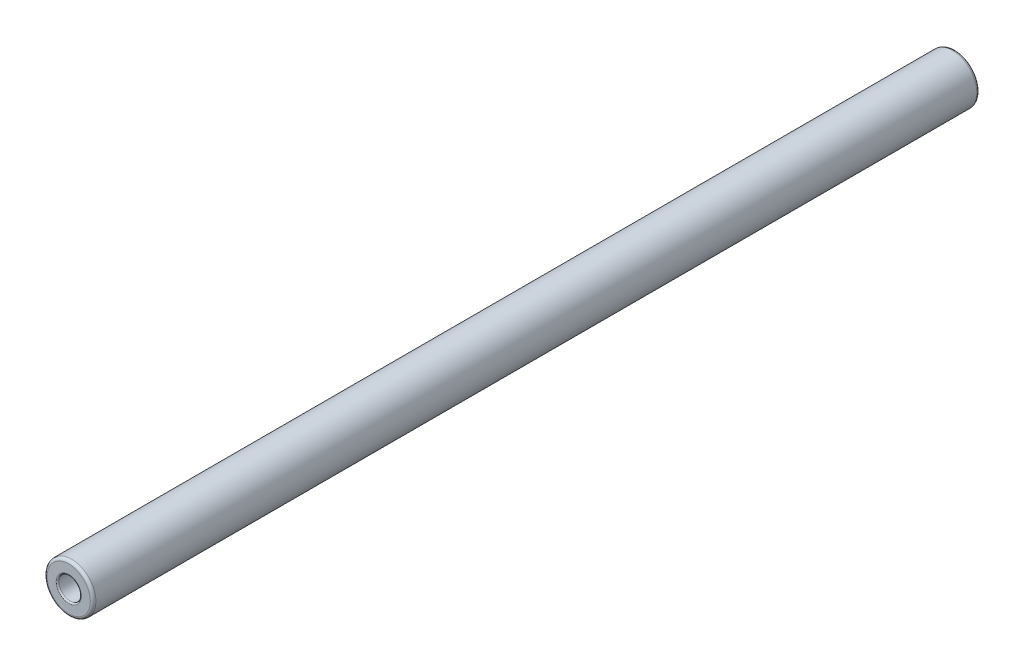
ISO-10303-21;
HEADER;
FILE_DESCRIPTION(('STEP AP214'),'2;1');
FILE_NAME('part.step','',(''),(''),'','','');
FILE_SCHEMA(('AUTOMOTIVE_DESIGN { 1 0 10303 214 1 1 1 1 }'));
ENDSEC;
DATA;
#1=APPLICATION_CONTEXT('core data for automotive mechanical design processes');
#2=APPLICATION_PROTOCOL_DEFINITION('international standard','automotive_design',2000,#1);
#3=PRODUCT_CONTEXT('',#1,'mechanical');
#4=PRODUCT('Part','Part','',(#3));
#5=PRODUCT_RELATED_PRODUCT_CATEGORY('part','',(#4));
#6=PRODUCT_DEFINITION_FORMATION('','',#4);
#7=PRODUCT_DEFINITION_CONTEXT('part definition',#1,'design');
#8=PRODUCT_DEFINITION('design','',#6,#7);
#9=PRODUCT_DEFINITION_SHAPE('','',#8);
#10=(LENGTH_UNIT() NAMED_UNIT(*) SI_UNIT(.MILLI.,.METRE.));
#11=(NAMED_UNIT(*) PLANE_ANGLE_UNIT() SI_UNIT($,.RADIAN.));
#12=(NAMED_UNIT(*) SI_UNIT($,.STERADIAN.) SOLID_ANGLE_UNIT());
#13=UNCERTAINTY_MEASURE_WITH_UNIT(LENGTH_MEASURE(1.E-05),#10,'distance_accuracy_value','');
#14=(GEOMETRIC_REPRESENTATION_CONTEXT(3) GLOBAL_UNCERTAINTY_ASSIGNED_CONTEXT((#13)) GLOBAL_UNIT_ASSIGNED_CONTEXT((#10,
#11,#12)) REPRESENTATION_CONTEXT('',''));
#15=CARTESIAN_POINT('',(0.,0.,0.));
#16=DIRECTION('',(0.,0.,1.));
#17=DIRECTION('',(1.,0.,0.));
#18=AXIS2_PLACEMENT_3D('',#15,#16,#17);
#19=CARTESIAN_POINT('',(0.,0.,0.));
#20=DIRECTION('',(0.,0.,1.));
#21=DIRECTION('',(1.,0.,0.));
#22=AXIS2_PLACEMENT_3D('',#19,#20,#21);
#23=PLANE('',#22);
#24=CARTESIAN_POINT('',(0.,0.,0.));
#25=DIRECTION('',(0.,0.,1.));
#26=DIRECTION('',(1.,0.,0.));
#27=AXIS2_PLACEMENT_3D('',#24,#25,#26);
#28=CIRCLE('',#27,9.);
#29=CARTESIAN_POINT('',(9.,0.,0.));
#30=VERTEX_POINT('',#29);
#31=EDGE_CURVE('E10',#30,#30,#28,.F.);
#32=ORIENTED_EDGE('',*,*,#31,.T.);
#33=EDGE_LOOP('',(#32));
#34=FACE_BOUND('',#33,.T.);
#35=CARTESIAN_POINT('',(0.,0.,0.));
#36=DIRECTION('',(0.,0.,1.));
#37=DIRECTION('',(1.,0.,0.));
#38=AXIS2_PLACEMENT_3D('',#35,#36,#37);
#39=CIRCLE('',#38,15.5);
#40=CARTESIAN_POINT('',(15.5,0.,0.));
#41=VERTEX_POINT('',#40);
#42=EDGE_CURVE('E62',#41,#41,#39,.T.);
#43=ORIENTED_EDGE('',*,*,#42,.T.);
#44=EDGE_LOOP('',(#43));
#45=FACE_BOUND('',#44,.T.);
#46=ADVANCED_FACE('F33',(#34,#45),#23,.T.);
#47=CARTESIAN_POINT('',(0.,0.,-636.));
#48=DIRECTION('',(0.,0.,1.));
#49=DIRECTION('',(1.,0.,0.));
#50=AXIS2_PLACEMENT_3D('',#47,#48,#49);
#51=PLANE('',#50);
#52=CARTESIAN_POINT('',(0.,0.,-636.));
#53=DIRECTION('',(0.,0.,1.));
#54=DIRECTION('',(1.,0.,0.));
#55=AXIS2_PLACEMENT_3D('',#52,#53,#54);
#56=CIRCLE('',#55,9.);
#57=CARTESIAN_POINT('',(9.,0.,-636.));
#58=VERTEX_POINT('',#57);
#59=EDGE_CURVE('E44',#58,#58,#56,.T.);
#60=ORIENTED_EDGE('',*,*,#59,.T.);
#61=EDGE_LOOP('',(#60));
#62=FACE_BOUND('',#61,.T.);
#63=CARTESIAN_POINT('',(0.,0.,-636.));
#64=DIRECTION('',(0.,0.,1.));
#65=DIRECTION('',(1.,0.,0.));
#66=AXIS2_PLACEMENT_3D('',#63,#64,#65);
#67=CIRCLE('',#66,15.5);
#68=CARTESIAN_POINT('',(15.5,0.,-636.));
#69=VERTEX_POINT('',#68);
#70=EDGE_CURVE('E53',#69,#69,#67,.F.);
#71=ORIENTED_EDGE('',*,*,#70,.T.);
#72=EDGE_LOOP('',(#71));
#73=FACE_BOUND('',#72,.T.);
#74=ADVANCED_FACE('F90',(#62,#73),#51,.F.);
#75=CARTESIAN_POINT('',(0.,0.,0.));
#76=DIRECTION('',(0.,0.,-1.));
#77=DIRECTION('',(-1.,0.,0.));
#78=AXIS2_PLACEMENT_3D('',#75,#76,#77);
#79=CYLINDRICAL_SURFACE('',#78,17.5);
#80=CARTESIAN_POINT('',(0.,0.,-2.));
#81=DIRECTION('',(0.,0.,1.));
#82=DIRECTION('',(1.,0.,0.));
#83=AXIS2_PLACEMENT_3D('',#80,#81,#82);
#84=CIRCLE('',#83,17.5);
#85=CARTESIAN_POINT('',(17.5,0.,-2.));
#86=VERTEX_POINT('',#85);
#87=EDGE_CURVE('E56',#86,#86,#84,.F.);
#88=ORIENTED_EDGE('',*,*,#87,.T.);
#89=EDGE_LOOP('',(#88));
#90=FACE_BOUND('',#89,.T.);
#91=CARTESIAN_POINT('',(0.,0.,-634.));
#92=DIRECTION('',(0.,0.,1.));
#93=DIRECTION('',(1.,0.,0.));
#94=AXIS2_PLACEMENT_3D('',#91,#92,#93);
#95=CIRCLE('',#94,17.5);
#96=CARTESIAN_POINT('',(17.5,0.,-634.));
#97=VERTEX_POINT('',#96);
#98=EDGE_CURVE('E59',#97,#97,#95,.T.);
#99=ORIENTED_EDGE('',*,*,#98,.T.);
#100=EDGE_LOOP('',(#99));
#101=FACE_BOUND('',#100,.T.);
#102=ADVANCED_FACE('F87',(#90,#101),#79,.T.);
#103=CARTESIAN_POINT('',(0.,0.,-2.));
#104=DIRECTION('',(0.,0.,1.));
#105=DIRECTION('',(1.,0.,0.));
#106=AXIS2_PLACEMENT_3D('',#103,#104,#105);
#107=TOROIDAL_SURFACE('',#106,15.5,2.);
#108=ORIENTED_EDGE('',*,*,#87,.F.);
#109=EDGE_LOOP('',(#108));
#110=FACE_BOUND('',#109,.T.);
#111=ORIENTED_EDGE('',*,*,#42,.F.);
#112=EDGE_LOOP('',(#111));
#113=FACE_BOUND('',#112,.T.);
#114=ADVANCED_FACE('F89',(#110,#113),#107,.T.);
#115=CARTESIAN_POINT('',(0.,0.,-634.));
#116=DIRECTION('',(0.,0.,1.));
#117=DIRECTION('',(1.,0.,0.));
#118=AXIS2_PLACEMENT_3D('',#115,#116,#117);
#119=TOROIDAL_SURFACE('',#118,15.5,2.);
#120=ORIENTED_EDGE('',*,*,#70,.F.);
#121=EDGE_LOOP('',(#120));
#122=FACE_BOUND('',#121,.T.);
#123=ORIENTED_EDGE('',*,*,#98,.F.);
#124=EDGE_LOOP('',(#123));
#125=FACE_BOUND('',#124,.T.);
#126=ADVANCED_FACE('F97',(#122,#125),#119,.T.);
#127=CARTESIAN_POINT('',(0.,0.,-561.));
#128=DIRECTION('',(0.,0.,-1.));
#129=DIRECTION('',(-1.,0.,0.));
#130=AXIS2_PLACEMENT_3D('',#127,#128,#129);
#131=CYLINDRICAL_SURFACE('',#130,8.);
#132=CARTESIAN_POINT('',(0.,0.,-635.));
#133=DIRECTION('',(0.,0.,1.));
#134=DIRECTION('',(1.,0.,0.));
#135=AXIS2_PLACEMENT_3D('',#132,#133,#134);
#136=CIRCLE('',#135,8.);
#137=CARTESIAN_POINT('',(8.,0.,-635.));
#138=VERTEX_POINT('',#137);
#139=EDGE_CURVE('E48',#138,#138,#136,.F.);
#140=ORIENTED_EDGE('',*,*,#139,.T.);
#141=EDGE_LOOP('',(#140));
#142=FACE_BOUND('',#141,.T.);
#143=CARTESIAN_POINT('',(0.,0.,-561.));
#144=DIRECTION('',(0.,0.,-1.));
#145=DIRECTION('',(-1.,0.,0.));
#146=AXIS2_PLACEMENT_3D('',#143,#144,#145);
#147=CIRCLE('',#146,8.);
#148=CARTESIAN_POINT('',(-8.,0.,-561.));
#149=VERTEX_POINT('',#148);
#150=EDGE_CURVE('E65',#149,#149,#147,.T.);
#151=ORIENTED_EDGE('',*,*,#150,.F.);
#152=EDGE_LOOP('',(#151));
#153=FACE_BOUND('',#152,.T.);
#154=ADVANCED_FACE('F84',(#142,#153),#131,.F.);
#155=CARTESIAN_POINT('',(0.,0.,-561.));
#156=DIRECTION('',(0.,0.,-1.));
#157=DIRECTION('',(-1.,0.,0.));
#158=AXIS2_PLACEMENT_3D('',#155,#156,#157);
#159=PLANE('',#158);
#160=ORIENTED_EDGE('',*,*,#150,.T.);
#161=EDGE_LOOP('',(#160));
#162=FACE_BOUND('',#161,.T.);
#163=ADVANCED_FACE('F76',(#162),#159,.T.);
#164=CARTESIAN_POINT('',(0.,0.,-75.));
#165=DIRECTION('',(0.,0.,1.));
#166=DIRECTION('',(1.,0.,0.));
#167=AXIS2_PLACEMENT_3D('',#164,#165,#166);
#168=CYLINDRICAL_SURFACE('',#167,8.);
#169=CARTESIAN_POINT('',(0.,0.,-1.));
#170=DIRECTION('',(0.,0.,1.));
#171=DIRECTION('',(1.,0.,0.));
#172=AXIS2_PLACEMENT_3D('',#169,#170,#171);
#173=CIRCLE('',#172,8.);
#174=CARTESIAN_POINT('',(8.,0.,-1.));
#175=VERTEX_POINT('',#174);
#176=EDGE_CURVE('E40',#175,#175,#173,.T.);
#177=ORIENTED_EDGE('',*,*,#176,.T.);
#178=EDGE_LOOP('',(#177));
#179=FACE_BOUND('',#178,.T.);
#180=CARTESIAN_POINT('',(0.,0.,-75.));
#181=DIRECTION('',(0.,0.,1.));
#182=DIRECTION('',(1.,0.,0.));
#183=AXIS2_PLACEMENT_3D('',#180,#181,#182);
#184=CIRCLE('',#183,8.);
#185=CARTESIAN_POINT('',(8.,0.,-75.));
#186=VERTEX_POINT('',#185);
#187=EDGE_CURVE('E68',#186,#186,#184,.T.);
#188=ORIENTED_EDGE('',*,*,#187,.F.);
#189=EDGE_LOOP('',(#188));
#190=FACE_BOUND('',#189,.T.);
#191=ADVANCED_FACE('F74',(#179,#190),#168,.F.);
#192=CARTESIAN_POINT('',(0.,0.,-75.));
#193=DIRECTION('',(0.,0.,1.));
#194=DIRECTION('',(1.,0.,0.));
#195=AXIS2_PLACEMENT_3D('',#192,#193,#194);
#196=PLANE('',#195);
#197=ORIENTED_EDGE('',*,*,#187,.T.);
#198=EDGE_LOOP('',(#197));
#199=FACE_BOUND('',#198,.T.);
#200=ADVANCED_FACE('F72',(#199),#196,.T.);
#201=CARTESIAN_POINT('',(0.,0.,-635.));
#202=DIRECTION('',(0.,0.,1.));
#203=DIRECTION('',(1.,0.,0.));
#204=AXIS2_PLACEMENT_3D('',#201,#202,#203);
#205=TOROIDAL_SURFACE('',#204,9.,1.);
#206=ORIENTED_EDGE('',*,*,#59,.F.);
#207=EDGE_LOOP('',(#206));
#208=FACE_BOUND('',#207,.T.);
#209=ORIENTED_EDGE('',*,*,#139,.F.);
#210=EDGE_LOOP('',(#209));
#211=FACE_BOUND('',#210,.T.);
#212=ADVANCED_FACE('F82',(#208,#211),#205,.T.);
#213=CARTESIAN_POINT('',(0.,0.,-1.));
#214=DIRECTION('',(0.,0.,1.));
#215=DIRECTION('',(1.,0.,0.));
#216=AXIS2_PLACEMENT_3D('',#213,#214,#215);
#217=TOROIDAL_SURFACE('',#216,9.,1.);
#218=ORIENTED_EDGE('',*,*,#31,.F.);
#219=EDGE_LOOP('',(#218));
#220=FACE_BOUND('',#219,.T.);
#221=ORIENTED_EDGE('',*,*,#176,.F.);
#222=EDGE_LOOP('',(#221));
#223=FACE_BOUND('',#222,.T.);
#224=ADVANCED_FACE('F35',(#220,#223),#217,.T.);
#225=CLOSED_SHELL('',(#46,#74,#102,#114,#126,#154,#163,#191,#200,#212,#224));
#226=MANIFOLD_SOLID_BREP('B2',#225);
#227=ADVANCED_BREP_SHAPE_REPRESENTATION('',(#18,#226),#14);
#228=SHAPE_DEFINITION_REPRESENTATION(#9,#227);
ENDSEC;
END-ISO-10303-21;
